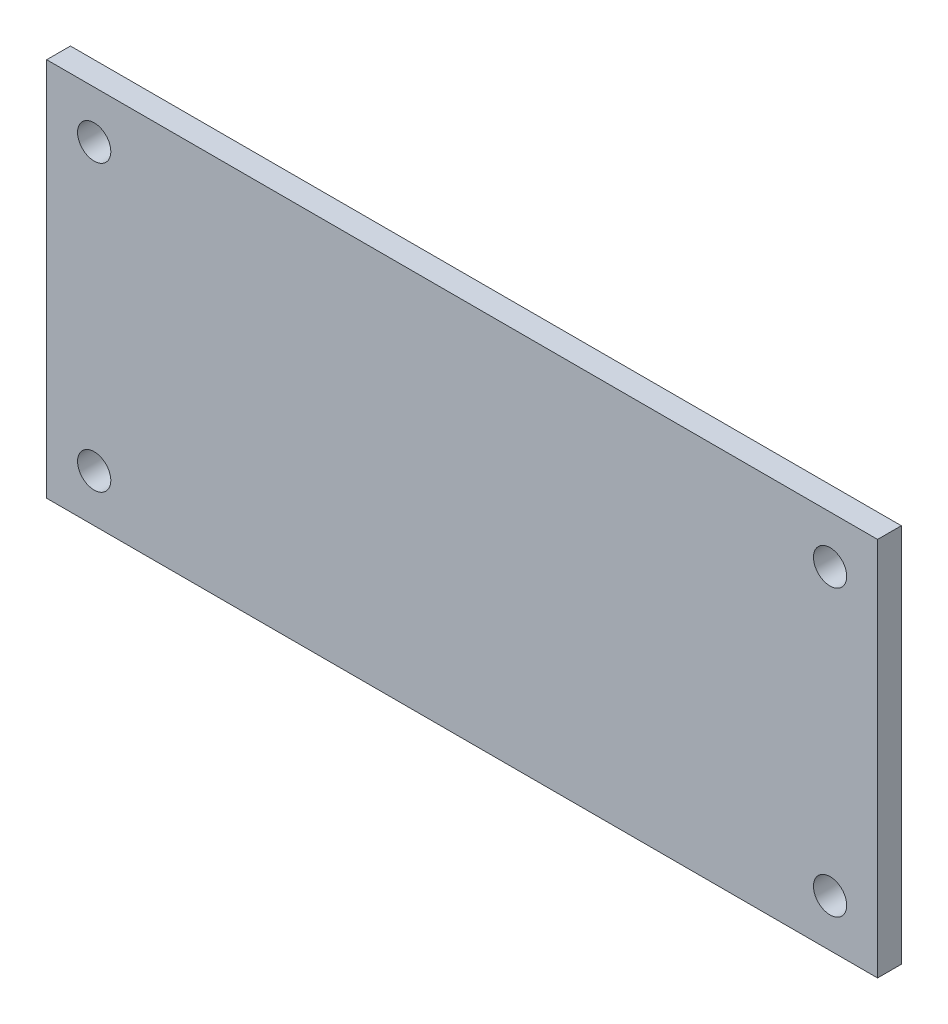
ISO-10303-21;
HEADER;
FILE_DESCRIPTION(('STEP AP214'),'2;1');
FILE_NAME('part.step','',(''),(''),'','','');
FILE_SCHEMA(('AUTOMOTIVE_DESIGN { 1 0 10303 214 1 1 1 1 }'));
ENDSEC;
DATA;
#1=APPLICATION_CONTEXT('core data for automotive mechanical design processes');
#2=APPLICATION_PROTOCOL_DEFINITION('international standard','automotive_design',2000,#1);
#3=PRODUCT_CONTEXT('',#1,'mechanical');
#4=PRODUCT('Part','Part','',(#3));
#5=PRODUCT_RELATED_PRODUCT_CATEGORY('part','',(#4));
#6=PRODUCT_DEFINITION_FORMATION('','',#4);
#7=PRODUCT_DEFINITION_CONTEXT('part definition',#1,'design');
#8=PRODUCT_DEFINITION('design','',#6,#7);
#9=PRODUCT_DEFINITION_SHAPE('','',#8);
#10=(LENGTH_UNIT() NAMED_UNIT(*) SI_UNIT(.MILLI.,.METRE.));
#11=(NAMED_UNIT(*) PLANE_ANGLE_UNIT() SI_UNIT($,.RADIAN.));
#12=(NAMED_UNIT(*) SI_UNIT($,.STERADIAN.) SOLID_ANGLE_UNIT());
#13=UNCERTAINTY_MEASURE_WITH_UNIT(LENGTH_MEASURE(1.E-05),#10,'distance_accuracy_value','');
#14=(GEOMETRIC_REPRESENTATION_CONTEXT(3) GLOBAL_UNCERTAINTY_ASSIGNED_CONTEXT((#13)) GLOBAL_UNIT_ASSIGNED_CONTEXT((#10,
#11,#12)) REPRESENTATION_CONTEXT('',''));
#15=CARTESIAN_POINT('',(0.,0.,0.));
#16=DIRECTION('',(0.,0.,1.));
#17=DIRECTION('',(1.,0.,0.));
#18=AXIS2_PLACEMENT_3D('',#15,#16,#17);
#19=CARTESIAN_POINT('',(-175.,45.0000000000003,10.));
#20=DIRECTION('',(0.,0.,0.999999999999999));
#21=DIRECTION('',(1.,0.,0.));
#22=AXIS2_PLACEMENT_3D('',#19,#20,#21);
#23=PLANE('',#22);
#24=CARTESIAN_POINT('',(155.,-95.0000000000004,10.));
#25=DIRECTION('',(0.,0.,0.999999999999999));
#26=DIRECTION('',(1.,0.,0.));
#27=AXIS2_PLACEMENT_3D('',#24,#25,#26);
#28=CIRCLE('',#27,7.00000000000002);
#29=CARTESIAN_POINT('',(148.,-95.0000000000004,10.));
#30=VERTEX_POINT('',#29);
#31=EDGE_CURVE('E127',#30,#30,#28,.T.);
#32=ORIENTED_EDGE('',*,*,#31,.F.);
#33=EDGE_LOOP('',(#32));
#34=FACE_BOUND('',#33,.T.);
#35=CARTESIAN_POINT('',(-155.,25.0000000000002,10.0000000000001));
#36=DIRECTION('',(0.,0.,0.999999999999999));
#37=DIRECTION('',(1.,0.,0.));
#38=AXIS2_PLACEMENT_3D('',#35,#36,#37);
#39=CIRCLE('',#38,7.00000000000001);
#40=CARTESIAN_POINT('',(-162.,25.0000000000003,10.0000000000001));
#41=VERTEX_POINT('',#40);
#42=EDGE_CURVE('E89',#41,#41,#39,.T.);
#43=ORIENTED_EDGE('',*,*,#42,.F.);
#44=EDGE_LOOP('',(#43));
#45=FACE_BOUND('',#44,.T.);
#46=DIRECTION('',(0.,-1.,0.));
#47=VECTOR('',#46,1.);
#48=CARTESIAN_POINT('',(-175.,45.0000000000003,10.));
#49=LINE('',#48,#47);
#50=CARTESIAN_POINT('',(-175.,45.0000000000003,10.));
#51=VERTEX_POINT('',#50);
#52=CARTESIAN_POINT('',(-175.,-115.,10.0000000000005));
#53=VERTEX_POINT('',#52);
#54=EDGE_CURVE('E99',#51,#53,#49,.T.);
#55=ORIENTED_EDGE('',*,*,#54,.T.);
#56=DIRECTION('',(1.,0.,0.));
#57=VECTOR('',#56,1.);
#58=CARTESIAN_POINT('',(-175.,-115.,10.0000000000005));
#59=LINE('',#58,#57);
#60=CARTESIAN_POINT('',(175.,-115.,10.0000000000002));
#61=VERTEX_POINT('',#60);
#62=EDGE_CURVE('E84',#53,#61,#59,.T.);
#63=ORIENTED_EDGE('',*,*,#62,.T.);
#64=DIRECTION('',(0.,1.,0.));
#65=VECTOR('',#64,1.);
#66=CARTESIAN_POINT('',(175.,44.9999999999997,10.));
#67=LINE('',#66,#65);
#68=CARTESIAN_POINT('',(175.,44.9999999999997,10.));
#69=VERTEX_POINT('',#68);
#70=EDGE_CURVE('E50',#61,#69,#67,.T.);
#71=ORIENTED_EDGE('',*,*,#70,.T.);
#72=DIRECTION('',(-1.,0.,0.));
#73=VECTOR('',#72,1.);
#74=CARTESIAN_POINT('',(-175.,45.0000000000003,10.));
#75=LINE('',#74,#73);
#76=EDGE_CURVE('E45',#69,#51,#75,.T.);
#77=ORIENTED_EDGE('',*,*,#76,.T.);
#78=EDGE_LOOP('',(#55,#63,#71,#77));
#79=FACE_BOUND('',#78,.T.);
#80=CARTESIAN_POINT('',(-155.,-94.9999999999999,10.));
#81=DIRECTION('',(0.,0.,0.999999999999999));
#82=DIRECTION('',(1.,0.,0.));
#83=AXIS2_PLACEMENT_3D('',#80,#81,#82);
#84=CIRCLE('',#83,7.00000000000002);
#85=CARTESIAN_POINT('',(-162.,-94.9999999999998,10.));
#86=VERTEX_POINT('',#85);
#87=EDGE_CURVE('E118',#86,#86,#84,.T.);
#88=ORIENTED_EDGE('',*,*,#87,.F.);
#89=EDGE_LOOP('',(#88));
#90=FACE_BOUND('',#89,.T.);
#91=CARTESIAN_POINT('',(155.,24.9999999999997,10.));
#92=DIRECTION('',(0.,0.,0.999999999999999));
#93=DIRECTION('',(1.,0.,0.));
#94=AXIS2_PLACEMENT_3D('',#91,#92,#93);
#95=CIRCLE('',#94,7.00000000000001);
#96=CARTESIAN_POINT('',(148.,24.9999999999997,10.));
#97=VERTEX_POINT('',#96);
#98=EDGE_CURVE('E121',#97,#97,#95,.T.);
#99=ORIENTED_EDGE('',*,*,#98,.F.);
#100=EDGE_LOOP('',(#99));
#101=FACE_BOUND('',#100,.T.);
#102=ADVANCED_FACE('F30',(#34,#45,#79,#90,#101),#23,.T.);
#103=CARTESIAN_POINT('',(-175.,45.0000000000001,1.11022302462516E-13));
#104=DIRECTION('',(0.,0.,0.999999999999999));
#105=DIRECTION('',(1.,0.,0.));
#106=AXIS2_PLACEMENT_3D('',#103,#104,#105);
#107=PLANE('',#106);
#108=CARTESIAN_POINT('',(155.,-95.0000000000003,2.22044604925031E-13));
#109=DIRECTION('',(0.,0.,0.999999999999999));
#110=DIRECTION('',(1.,0.,0.));
#111=AXIS2_PLACEMENT_3D('',#108,#109,#110);
#112=CIRCLE('',#111,7.00000000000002);
#113=CARTESIAN_POINT('',(148.,-95.0000000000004,2.22044604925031E-13));
#114=VERTEX_POINT('',#113);
#115=EDGE_CURVE('E123',#114,#114,#112,.T.);
#116=ORIENTED_EDGE('',*,*,#115,.T.);
#117=EDGE_LOOP('',(#116));
#118=FACE_BOUND('',#117,.T.);
#119=CARTESIAN_POINT('',(-155.,25.0000000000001,1.11022302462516E-13));
#120=DIRECTION('',(0.,0.,0.999999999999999));
#121=DIRECTION('',(1.,0.,0.));
#122=AXIS2_PLACEMENT_3D('',#119,#120,#121);
#123=CIRCLE('',#122,7.00000000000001);
#124=CARTESIAN_POINT('',(-162.,25.0000000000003,1.11022302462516E-13));
#125=VERTEX_POINT('',#124);
#126=EDGE_CURVE('E92',#125,#125,#123,.T.);
#127=ORIENTED_EDGE('',*,*,#126,.T.);
#128=EDGE_LOOP('',(#127));
#129=FACE_BOUND('',#128,.T.);
#130=DIRECTION('',(0.,-1.,0.));
#131=VECTOR('',#130,1.);
#132=CARTESIAN_POINT('',(-175.,45.0000000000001,1.11022302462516E-13));
#133=LINE('',#132,#131);
#134=CARTESIAN_POINT('',(-175.,45.0000000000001,1.11022302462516E-13));
#135=VERTEX_POINT('',#134);
#136=CARTESIAN_POINT('',(-175.,-115.,5.55111512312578E-13));
#137=VERTEX_POINT('',#136);
#138=EDGE_CURVE('E76',#135,#137,#133,.T.);
#139=ORIENTED_EDGE('',*,*,#138,.F.);
#140=DIRECTION('',(-1.,0.,0.));
#141=VECTOR('',#140,1.);
#142=CARTESIAN_POINT('',(-175.,45.0000000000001,1.11022302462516E-13));
#143=LINE('',#142,#141);
#144=CARTESIAN_POINT('',(175.,44.9999999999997,1.11022302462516E-13));
#145=VERTEX_POINT('',#144);
#146=EDGE_CURVE('E97',#145,#135,#143,.T.);
#147=ORIENTED_EDGE('',*,*,#146,.F.);
#148=DIRECTION('',(0.,1.,0.));
#149=VECTOR('',#148,1.);
#150=CARTESIAN_POINT('',(175.,44.9999999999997,1.11022302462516E-13));
#151=LINE('',#150,#149);
#152=CARTESIAN_POINT('',(175.,-115.,4.44089209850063E-13));
#153=VERTEX_POINT('',#152);
#154=EDGE_CURVE('E77',#153,#145,#151,.T.);
#155=ORIENTED_EDGE('',*,*,#154,.F.);
#156=DIRECTION('',(1.,0.,0.));
#157=VECTOR('',#156,1.);
#158=CARTESIAN_POINT('',(-175.,-115.,5.55111512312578E-13));
#159=LINE('',#158,#157);
#160=EDGE_CURVE('E71',#137,#153,#159,.T.);
#161=ORIENTED_EDGE('',*,*,#160,.F.);
#162=EDGE_LOOP('',(#139,#147,#155,#161));
#163=FACE_BOUND('',#162,.T.);
#164=CARTESIAN_POINT('',(-155.,-94.9999999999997,0.));
#165=DIRECTION('',(0.,0.,0.999999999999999));
#166=DIRECTION('',(1.,0.,0.));
#167=AXIS2_PLACEMENT_3D('',#164,#165,#166);
#168=CIRCLE('',#167,7.00000000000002);
#169=CARTESIAN_POINT('',(-162.,-94.9999999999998,0.));
#170=VERTEX_POINT('',#169);
#171=EDGE_CURVE('E134',#170,#170,#168,.T.);
#172=ORIENTED_EDGE('',*,*,#171,.T.);
#173=EDGE_LOOP('',(#172));
#174=FACE_BOUND('',#173,.T.);
#175=CARTESIAN_POINT('',(155.,24.9999999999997,0.));
#176=DIRECTION('',(0.,0.,0.999999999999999));
#177=DIRECTION('',(1.,0.,0.));
#178=AXIS2_PLACEMENT_3D('',#175,#176,#177);
#179=CIRCLE('',#178,7.00000000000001);
#180=CARTESIAN_POINT('',(148.,24.9999999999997,0.));
#181=VERTEX_POINT('',#180);
#182=EDGE_CURVE('E124',#181,#181,#179,.T.);
#183=ORIENTED_EDGE('',*,*,#182,.T.);
#184=EDGE_LOOP('',(#183));
#185=FACE_BOUND('',#184,.T.);
#186=ADVANCED_FACE('F72',(#118,#129,#163,#174,#185),#107,.F.);
#187=CARTESIAN_POINT('',(-175.,45.0000000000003,10.));
#188=DIRECTION('',(1.,0.,0.));
#189=DIRECTION('',(0.,0.,-0.999999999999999));
#190=AXIS2_PLACEMENT_3D('',#187,#188,#189);
#191=PLANE('',#190);
#192=ORIENTED_EDGE('',*,*,#138,.T.);
#193=DIRECTION('',(0.,0.,-0.999999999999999));
#194=VECTOR('',#193,1.);
#195=CARTESIAN_POINT('',(-175.,-115.,10.0000000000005));
#196=LINE('',#195,#194);
#197=EDGE_CURVE('E11',#53,#137,#196,.T.);
#198=ORIENTED_EDGE('',*,*,#197,.F.);
#199=ORIENTED_EDGE('',*,*,#54,.F.);
#200=DIRECTION('',(0.,0.,-0.999999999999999));
#201=VECTOR('',#200,1.);
#202=CARTESIAN_POINT('',(-175.,45.0000000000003,10.));
#203=LINE('',#202,#201);
#204=EDGE_CURVE('E88',#51,#135,#203,.T.);
#205=ORIENTED_EDGE('',*,*,#204,.T.);
#206=EDGE_LOOP('',(#192,#198,#199,#205));
#207=FACE_BOUND('',#206,.T.);
#208=ADVANCED_FACE('F32',(#207),#191,.F.);
#209=CARTESIAN_POINT('',(-175.,-115.,10.0000000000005));
#210=DIRECTION('',(0.,1.,0.));
#211=DIRECTION('',(-1.,0.,0.));
#212=AXIS2_PLACEMENT_3D('',#209,#210,#211);
#213=PLANE('',#212);
#214=ORIENTED_EDGE('',*,*,#160,.T.);
#215=DIRECTION('',(0.,0.,-0.999999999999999));
#216=VECTOR('',#215,1.);
#217=CARTESIAN_POINT('',(175.,-115.,10.0000000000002));
#218=LINE('',#217,#216);
#219=EDGE_CURVE('E38',#61,#153,#218,.T.);
#220=ORIENTED_EDGE('',*,*,#219,.F.);
#221=ORIENTED_EDGE('',*,*,#62,.F.);
#222=ORIENTED_EDGE('',*,*,#197,.T.);
#223=EDGE_LOOP('',(#214,#220,#221,#222));
#224=FACE_BOUND('',#223,.T.);
#225=ADVANCED_FACE('F83',(#224),#213,.F.);
#226=CARTESIAN_POINT('',(175.,44.9999999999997,10.));
#227=DIRECTION('',(-1.,0.,0.));
#228=DIRECTION('',(0.,0.,0.999999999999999));
#229=AXIS2_PLACEMENT_3D('',#226,#227,#228);
#230=PLANE('',#229);
#231=ORIENTED_EDGE('',*,*,#154,.T.);
#232=DIRECTION('',(0.,0.,-0.999999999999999));
#233=VECTOR('',#232,1.);
#234=CARTESIAN_POINT('',(175.,44.9999999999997,10.));
#235=LINE('',#234,#233);
#236=EDGE_CURVE('E105',#69,#145,#235,.T.);
#237=ORIENTED_EDGE('',*,*,#236,.F.);
#238=ORIENTED_EDGE('',*,*,#70,.F.);
#239=ORIENTED_EDGE('',*,*,#219,.T.);
#240=EDGE_LOOP('',(#231,#237,#238,#239));
#241=FACE_BOUND('',#240,.T.);
#242=ADVANCED_FACE('F108',(#241),#230,.F.);
#243=CARTESIAN_POINT('',(-175.,45.0000000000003,10.));
#244=DIRECTION('',(0.,-1.,0.));
#245=DIRECTION('',(0.,0.,-0.999999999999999));
#246=AXIS2_PLACEMENT_3D('',#243,#244,#245);
#247=PLANE('',#246);
#248=ORIENTED_EDGE('',*,*,#146,.T.);
#249=ORIENTED_EDGE('',*,*,#204,.F.);
#250=ORIENTED_EDGE('',*,*,#76,.F.);
#251=ORIENTED_EDGE('',*,*,#236,.T.);
#252=EDGE_LOOP('',(#248,#249,#250,#251));
#253=FACE_BOUND('',#252,.T.);
#254=ADVANCED_FACE('F110',(#253),#247,.F.);
#255=CARTESIAN_POINT('',(-155.,25.0000000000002,10.0000000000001));
#256=DIRECTION('',(0.,0.,-0.999999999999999));
#257=DIRECTION('',(-1.,0.,0.));
#258=AXIS2_PLACEMENT_3D('',#255,#256,#257);
#259=CYLINDRICAL_SURFACE('',#258,7.00000000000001);
#260=CARTESIAN_POINT('',(-162.,25.0000000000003,10.0000000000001));
#261=CARTESIAN_POINT('',(-162.,25.0000000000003,9.89583333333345));
#262=CARTESIAN_POINT('',(-162.,25.0000000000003,9.79166666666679));
#263=CARTESIAN_POINT('',(-162.,25.0000000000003,9.58333333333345));
#264=CARTESIAN_POINT('',(-162.,25.0000000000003,9.47916666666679));
#265=CARTESIAN_POINT('',(-162.,25.0000000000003,9.27083333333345));
#266=CARTESIAN_POINT('',(-162.,25.0000000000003,9.16666666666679));
#267=CARTESIAN_POINT('',(-162.,25.0000000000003,8.95833333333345));
#268=CARTESIAN_POINT('',(-162.,25.0000000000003,8.85416666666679));
#269=CARTESIAN_POINT('',(-162.,25.0000000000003,8.64583333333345));
#270=CARTESIAN_POINT('',(-162.,25.0000000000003,8.54166666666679));
#271=CARTESIAN_POINT('',(-162.,25.0000000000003,8.33333333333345));
#272=CARTESIAN_POINT('',(-162.,25.0000000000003,8.22916666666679));
#273=CARTESIAN_POINT('',(-162.,25.0000000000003,8.02083333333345));
#274=CARTESIAN_POINT('',(-162.,25.0000000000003,7.91666666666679));
#275=CARTESIAN_POINT('',(-162.,25.0000000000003,7.70833333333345));
#276=CARTESIAN_POINT('',(-162.,25.0000000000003,7.60416666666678));
#277=CARTESIAN_POINT('',(-162.,25.0000000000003,7.39583333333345));
#278=CARTESIAN_POINT('',(-162.,25.0000000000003,7.29166666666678));
#279=CARTESIAN_POINT('',(-162.,25.0000000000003,7.08333333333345));
#280=CARTESIAN_POINT('',(-162.,25.0000000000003,6.97916666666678));
#281=CARTESIAN_POINT('',(-162.,25.0000000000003,6.77083333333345));
#282=CARTESIAN_POINT('',(-162.,25.0000000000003,6.66666666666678));
#283=CARTESIAN_POINT('',(-162.,25.0000000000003,6.45833333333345));
#284=CARTESIAN_POINT('',(-162.,25.0000000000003,6.35416666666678));
#285=CARTESIAN_POINT('',(-162.,25.0000000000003,6.14583333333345));
#286=CARTESIAN_POINT('',(-162.,25.0000000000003,6.04166666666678));
#287=CARTESIAN_POINT('',(-162.,25.0000000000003,5.83333333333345));
#288=CARTESIAN_POINT('',(-162.,25.0000000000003,5.72916666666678));
#289=CARTESIAN_POINT('',(-162.,25.0000000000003,5.52083333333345));
#290=CARTESIAN_POINT('',(-162.,25.0000000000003,5.41666666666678));
#291=CARTESIAN_POINT('',(-162.,25.0000000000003,5.20833333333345));
#292=CARTESIAN_POINT('',(-162.,25.0000000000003,5.10416666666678));
#293=CARTESIAN_POINT('',(-162.,25.0000000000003,4.89583333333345));
#294=CARTESIAN_POINT('',(-162.,25.0000000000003,4.79166666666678));
#295=CARTESIAN_POINT('',(-162.,25.0000000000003,4.58333333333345));
#296=CARTESIAN_POINT('',(-162.,25.0000000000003,4.47916666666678));
#297=CARTESIAN_POINT('',(-162.,25.0000000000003,4.27083333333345));
#298=CARTESIAN_POINT('',(-162.,25.0000000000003,4.16666666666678));
#299=CARTESIAN_POINT('',(-162.,25.0000000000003,3.95833333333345));
#300=CARTESIAN_POINT('',(-162.,25.0000000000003,3.85416666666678));
#301=CARTESIAN_POINT('',(-162.,25.0000000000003,3.64583333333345));
#302=CARTESIAN_POINT('',(-162.,25.0000000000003,3.54166666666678));
#303=CARTESIAN_POINT('',(-162.,25.0000000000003,3.33333333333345));
#304=CARTESIAN_POINT('',(-162.,25.0000000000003,3.22916666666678));
#305=CARTESIAN_POINT('',(-162.,25.0000000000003,3.02083333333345));
#306=CARTESIAN_POINT('',(-162.,25.0000000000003,2.91666666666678));
#307=CARTESIAN_POINT('',(-162.,25.0000000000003,2.70833333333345));
#308=CARTESIAN_POINT('',(-162.,25.0000000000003,2.60416666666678));
#309=CARTESIAN_POINT('',(-162.,25.0000000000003,2.39583333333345));
#310=CARTESIAN_POINT('',(-162.,25.0000000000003,2.29166666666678));
#311=CARTESIAN_POINT('',(-162.,25.0000000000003,2.08333333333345));
#312=CARTESIAN_POINT('',(-162.,25.0000000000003,1.97916666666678));
#313=CARTESIAN_POINT('',(-162.,25.0000000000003,1.77083333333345));
#314=CARTESIAN_POINT('',(-162.,25.0000000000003,1.66666666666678));
#315=CARTESIAN_POINT('',(-162.,25.0000000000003,1.45833333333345));
#316=CARTESIAN_POINT('',(-162.,25.0000000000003,1.35416666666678));
#317=CARTESIAN_POINT('',(-162.,25.0000000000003,1.14583333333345));
#318=CARTESIAN_POINT('',(-162.,25.0000000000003,1.04166666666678));
#319=CARTESIAN_POINT('',(-162.,25.0000000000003,0.833333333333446));
#320=CARTESIAN_POINT('',(-162.,25.0000000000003,0.729166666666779));
#321=CARTESIAN_POINT('',(-162.,25.0000000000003,0.520833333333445));
#322=CARTESIAN_POINT('',(-162.,25.0000000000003,0.416666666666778));
#323=CARTESIAN_POINT('',(-162.,25.0000000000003,0.208333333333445));
#324=CARTESIAN_POINT('',(-162.,25.0000000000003,0.104166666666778));
#325=CARTESIAN_POINT('',(-162.,25.0000000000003,1.11022302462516E-13));
#326=B_SPLINE_CURVE_WITH_KNOTS('',3,(#260,#261,#262,#263,#264,#265,#266,#267,#268,#269,#270,
#271,#272,#273,#274,#275,#276,#277,#278,#279,#280,#281,#282,#283,#284,#285,#286,#287,#288,#289,
#290,#291,#292,#293,#294,#295,#296,#297,#298,#299,#300,#301,#302,#303,#304,#305,#306,#307,#308,
#309,#310,#311,#312,#313,#314,#315,#316,#317,#318,#319,#320,#321,#322,#323,#324,#325),
.UNSPECIFIED.,.F.,.F.,(4,2,2,2,2,2,2,2,2,2,2,2,2,2,2,2,2,2,2,2,2,2,2,2,2,2,2,2,2,2,2,2,4),(0.,
0.3125,0.625000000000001,0.937500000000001,1.25,1.5625,1.875,2.1875,2.5,2.8125,3.125,3.4375,
3.75,4.0625,4.375,4.68750000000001,5.00000000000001,5.3125,5.62500000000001,5.93750000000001,
6.25000000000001,6.56250000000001,6.87500000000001,7.18750000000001,7.50000000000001,
7.81250000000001,8.12500000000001,8.43750000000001,8.75000000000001,9.06250000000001,
9.37500000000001,9.68750000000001,10.),.UNSPECIFIED.);
#327=EDGE_CURVE('BSEAM141',#41,#125,#326,.T.);
#328=ORIENTED_EDGE('',*,*,#42,.T.);
#329=ORIENTED_EDGE('',*,*,#126,.F.);
#330=ORIENTED_EDGE('',*,*,#327,.T.);
#331=ORIENTED_EDGE('',*,*,#327,.F.);
#332=EDGE_LOOP('',(#328,#330,#329,#331));
#333=FACE_BOUND('',#332,.T.);
#334=ADVANCED_FACE('F141',(#333),#259,.F.);
#335=CARTESIAN_POINT('',(-155.,-94.9999999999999,10.));
#336=DIRECTION('',(0.,0.,-0.999999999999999));
#337=DIRECTION('',(-1.,0.,0.));
#338=AXIS2_PLACEMENT_3D('',#335,#336,#337);
#339=CYLINDRICAL_SURFACE('',#338,7.00000000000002);
#340=CARTESIAN_POINT('',(-162.,-94.9999999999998,10.));
#341=CARTESIAN_POINT('',(-162.,-94.9999999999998,9.89583333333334));
#342=CARTESIAN_POINT('',(-162.,-94.9999999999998,9.79166666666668));
#343=CARTESIAN_POINT('',(-162.,-94.9999999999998,9.58333333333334));
#344=CARTESIAN_POINT('',(-162.,-94.9999999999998,9.47916666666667));
#345=CARTESIAN_POINT('',(-162.,-94.9999999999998,9.27083333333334));
#346=CARTESIAN_POINT('',(-162.,-94.9999999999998,9.16666666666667));
#347=CARTESIAN_POINT('',(-162.,-94.9999999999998,8.95833333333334));
#348=CARTESIAN_POINT('',(-162.,-94.9999999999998,8.85416666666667));
#349=CARTESIAN_POINT('',(-162.,-94.9999999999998,8.64583333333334));
#350=CARTESIAN_POINT('',(-162.,-94.9999999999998,8.54166666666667));
#351=CARTESIAN_POINT('',(-162.,-94.9999999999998,8.33333333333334));
#352=CARTESIAN_POINT('',(-162.,-94.9999999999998,8.22916666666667));
#353=CARTESIAN_POINT('',(-162.,-94.9999999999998,8.02083333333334));
#354=CARTESIAN_POINT('',(-162.,-94.9999999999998,7.91666666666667));
#355=CARTESIAN_POINT('',(-162.,-94.9999999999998,7.70833333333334));
#356=CARTESIAN_POINT('',(-162.,-94.9999999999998,7.60416666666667));
#357=CARTESIAN_POINT('',(-162.,-94.9999999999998,7.39583333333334));
#358=CARTESIAN_POINT('',(-162.,-94.9999999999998,7.29166666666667));
#359=CARTESIAN_POINT('',(-162.,-94.9999999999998,7.08333333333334));
#360=CARTESIAN_POINT('',(-162.,-94.9999999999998,6.97916666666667));
#361=CARTESIAN_POINT('',(-162.,-94.9999999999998,6.77083333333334));
#362=CARTESIAN_POINT('',(-162.,-94.9999999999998,6.66666666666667));
#363=CARTESIAN_POINT('',(-162.,-94.9999999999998,6.45833333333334));
#364=CARTESIAN_POINT('',(-162.,-94.9999999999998,6.35416666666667));
#365=CARTESIAN_POINT('',(-162.,-94.9999999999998,6.14583333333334));
#366=CARTESIAN_POINT('',(-162.,-94.9999999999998,6.04166666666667));
#367=CARTESIAN_POINT('',(-162.,-94.9999999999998,5.83333333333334));
#368=CARTESIAN_POINT('',(-162.,-94.9999999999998,5.72916666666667));
#369=CARTESIAN_POINT('',(-162.,-94.9999999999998,5.52083333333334));
#370=CARTESIAN_POINT('',(-162.,-94.9999999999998,5.41666666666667));
#371=CARTESIAN_POINT('',(-162.,-94.9999999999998,5.20833333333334));
#372=CARTESIAN_POINT('',(-162.,-94.9999999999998,5.10416666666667));
#373=CARTESIAN_POINT('',(-162.,-94.9999999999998,4.89583333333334));
#374=CARTESIAN_POINT('',(-162.,-94.9999999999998,4.79166666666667));
#375=CARTESIAN_POINT('',(-162.,-94.9999999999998,4.58333333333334));
#376=CARTESIAN_POINT('',(-162.,-94.9999999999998,4.47916666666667));
#377=CARTESIAN_POINT('',(-162.,-94.9999999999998,4.27083333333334));
#378=CARTESIAN_POINT('',(-162.,-94.9999999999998,4.16666666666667));
#379=CARTESIAN_POINT('',(-162.,-94.9999999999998,3.95833333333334));
#380=CARTESIAN_POINT('',(-162.,-94.9999999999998,3.85416666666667));
#381=CARTESIAN_POINT('',(-162.,-94.9999999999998,3.64583333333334));
#382=CARTESIAN_POINT('',(-162.,-94.9999999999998,3.54166666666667));
#383=CARTESIAN_POINT('',(-162.,-94.9999999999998,3.33333333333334));
#384=CARTESIAN_POINT('',(-162.,-94.9999999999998,3.22916666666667));
#385=CARTESIAN_POINT('',(-162.,-94.9999999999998,3.02083333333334));
#386=CARTESIAN_POINT('',(-162.,-94.9999999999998,2.91666666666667));
#387=CARTESIAN_POINT('',(-162.,-94.9999999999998,2.70833333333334));
#388=CARTESIAN_POINT('',(-162.,-94.9999999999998,2.60416666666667));
#389=CARTESIAN_POINT('',(-162.,-94.9999999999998,2.39583333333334));
#390=CARTESIAN_POINT('',(-162.,-94.9999999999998,2.29166666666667));
#391=CARTESIAN_POINT('',(-162.,-94.9999999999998,2.08333333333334));
#392=CARTESIAN_POINT('',(-162.,-94.9999999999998,1.97916666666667));
#393=CARTESIAN_POINT('',(-162.,-94.9999999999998,1.77083333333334));
#394=CARTESIAN_POINT('',(-162.,-94.9999999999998,1.66666666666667));
#395=CARTESIAN_POINT('',(-162.,-94.9999999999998,1.45833333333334));
#396=CARTESIAN_POINT('',(-162.,-94.9999999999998,1.35416666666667));
#397=CARTESIAN_POINT('',(-162.,-94.9999999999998,1.14583333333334));
#398=CARTESIAN_POINT('',(-162.,-94.9999999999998,1.04166666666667));
#399=CARTESIAN_POINT('',(-162.,-94.9999999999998,0.833333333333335));
#400=CARTESIAN_POINT('',(-162.,-94.9999999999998,0.729166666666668));
#401=CARTESIAN_POINT('',(-162.,-94.9999999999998,0.520833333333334));
#402=CARTESIAN_POINT('',(-162.,-94.9999999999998,0.416666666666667));
#403=CARTESIAN_POINT('',(-162.,-94.9999999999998,0.208333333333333));
#404=CARTESIAN_POINT('',(-162.,-94.9999999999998,0.104166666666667));
#405=CARTESIAN_POINT('',(-162.,-94.9999999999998,0.));
#406=B_SPLINE_CURVE_WITH_KNOTS('',3,(#340,#341,#342,#343,#344,#345,#346,#347,#348,#349,#350,
#351,#352,#353,#354,#355,#356,#357,#358,#359,#360,#361,#362,#363,#364,#365,#366,#367,#368,#369,
#370,#371,#372,#373,#374,#375,#376,#377,#378,#379,#380,#381,#382,#383,#384,#385,#386,#387,#388,
#389,#390,#391,#392,#393,#394,#395,#396,#397,#398,#399,#400,#401,#402,#403,#404,#405),
.UNSPECIFIED.,.F.,.F.,(4,2,2,2,2,2,2,2,2,2,2,2,2,2,2,2,2,2,2,2,2,2,2,2,2,2,2,2,2,2,2,2,4),(0.,
0.3125,0.625000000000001,0.937500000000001,1.25,1.5625,1.875,2.1875,2.5,2.8125,3.125,3.4375,
3.75,4.0625,4.375,4.68750000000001,5.00000000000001,5.3125,5.62500000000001,5.93750000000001,
6.25000000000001,6.56250000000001,6.87500000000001,7.18750000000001,7.50000000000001,
7.81250000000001,8.12500000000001,8.43750000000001,8.75000000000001,9.06250000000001,
9.37500000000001,9.68750000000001,10.),.UNSPECIFIED.);
#407=EDGE_CURVE('BSEAM143',#86,#170,#406,.T.);
#408=ORIENTED_EDGE('',*,*,#87,.T.);
#409=ORIENTED_EDGE('',*,*,#171,.F.);
#410=ORIENTED_EDGE('',*,*,#407,.T.);
#411=ORIENTED_EDGE('',*,*,#407,.F.);
#412=EDGE_LOOP('',(#408,#410,#409,#411));
#413=FACE_BOUND('',#412,.T.);
#414=ADVANCED_FACE('F143',(#413),#339,.F.);
#415=CARTESIAN_POINT('',(155.,-95.0000000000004,10.));
#416=DIRECTION('',(0.,0.,-0.999999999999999));
#417=DIRECTION('',(-1.,0.,0.));
#418=AXIS2_PLACEMENT_3D('',#415,#416,#417);
#419=CYLINDRICAL_SURFACE('',#418,7.00000000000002);
#420=CARTESIAN_POINT('',(148.,-95.0000000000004,10.));
#421=CARTESIAN_POINT('',(148.,-95.0000000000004,9.89583333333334));
#422=CARTESIAN_POINT('',(148.,-95.0000000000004,9.79166666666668));
#423=CARTESIAN_POINT('',(148.,-95.0000000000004,9.58333333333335));
#424=CARTESIAN_POINT('',(148.,-95.0000000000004,9.47916666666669));
#425=CARTESIAN_POINT('',(148.,-95.0000000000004,9.27083333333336));
#426=CARTESIAN_POINT('',(148.,-95.0000000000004,9.16666666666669));
#427=CARTESIAN_POINT('',(148.,-95.0000000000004,8.95833333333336));
#428=CARTESIAN_POINT('',(148.,-95.0000000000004,8.8541666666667));
#429=CARTESIAN_POINT('',(148.,-95.0000000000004,8.64583333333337));
#430=CARTESIAN_POINT('',(148.,-95.0000000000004,8.54166666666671));
#431=CARTESIAN_POINT('',(148.,-95.0000000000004,8.33333333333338));
#432=CARTESIAN_POINT('',(148.,-95.0000000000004,8.22916666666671));
#433=CARTESIAN_POINT('',(148.,-95.0000000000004,8.02083333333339));
#434=CARTESIAN_POINT('',(148.,-95.0000000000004,7.91666666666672));
#435=CARTESIAN_POINT('',(148.,-95.0000000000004,7.70833333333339));
#436=CARTESIAN_POINT('',(148.,-95.0000000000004,7.60416666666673));
#437=CARTESIAN_POINT('',(148.,-95.0000000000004,7.3958333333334));
#438=CARTESIAN_POINT('',(148.,-95.0000000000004,7.29166666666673));
#439=CARTESIAN_POINT('',(148.,-95.0000000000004,7.0833333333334));
#440=CARTESIAN_POINT('',(148.,-95.0000000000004,6.97916666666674));
#441=CARTESIAN_POINT('',(148.,-95.0000000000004,6.77083333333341));
#442=CARTESIAN_POINT('',(148.,-95.0000000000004,6.66666666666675));
#443=CARTESIAN_POINT('',(148.,-95.0000000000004,6.45833333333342));
#444=CARTESIAN_POINT('',(148.,-95.0000000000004,6.35416666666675));
#445=CARTESIAN_POINT('',(148.,-95.0000000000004,6.14583333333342));
#446=CARTESIAN_POINT('',(148.,-95.0000000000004,6.04166666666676));
#447=CARTESIAN_POINT('',(148.,-95.0000000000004,5.83333333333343));
#448=CARTESIAN_POINT('',(148.,-95.0000000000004,5.72916666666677));
#449=CARTESIAN_POINT('',(148.,-95.0000000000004,5.52083333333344));
#450=CARTESIAN_POINT('',(148.,-95.0000000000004,5.41666666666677));
#451=CARTESIAN_POINT('',(148.,-95.0000000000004,5.20833333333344));
#452=CARTESIAN_POINT('',(148.,-95.0000000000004,5.10416666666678));
#453=CARTESIAN_POINT('',(148.,-95.0000000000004,4.89583333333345));
#454=CARTESIAN_POINT('',(148.,-95.0000000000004,4.79166666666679));
#455=CARTESIAN_POINT('',(148.,-95.0000000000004,4.58333333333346));
#456=CARTESIAN_POINT('',(148.,-95.0000000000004,4.47916666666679));
#457=CARTESIAN_POINT('',(148.,-95.0000000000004,4.27083333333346));
#458=CARTESIAN_POINT('',(148.,-95.0000000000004,4.1666666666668));
#459=CARTESIAN_POINT('',(148.,-95.0000000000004,3.95833333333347));
#460=CARTESIAN_POINT('',(148.,-95.0000000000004,3.85416666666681));
#461=CARTESIAN_POINT('',(148.,-95.0000000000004,3.64583333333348));
#462=CARTESIAN_POINT('',(148.,-95.0000000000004,3.54166666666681));
#463=CARTESIAN_POINT('',(148.,-95.0000000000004,3.33333333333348));
#464=CARTESIAN_POINT('',(148.,-95.0000000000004,3.22916666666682));
#465=CARTESIAN_POINT('',(148.,-95.0000000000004,3.02083333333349));
#466=CARTESIAN_POINT('',(148.,-95.0000000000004,2.91666666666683));
#467=CARTESIAN_POINT('',(148.,-95.0000000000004,2.7083333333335));
#468=CARTESIAN_POINT('',(148.,-95.0000000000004,2.60416666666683));
#469=CARTESIAN_POINT('',(148.,-95.0000000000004,2.39583333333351));
#470=CARTESIAN_POINT('',(148.,-95.0000000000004,2.29166666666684));
#471=CARTESIAN_POINT('',(148.,-95.0000000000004,2.08333333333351));
#472=CARTESIAN_POINT('',(148.,-95.0000000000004,1.97916666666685));
#473=CARTESIAN_POINT('',(148.,-95.0000000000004,1.77083333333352));
#474=CARTESIAN_POINT('',(148.,-95.0000000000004,1.66666666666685));
#475=CARTESIAN_POINT('',(148.,-95.0000000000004,1.45833333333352));
#476=CARTESIAN_POINT('',(148.,-95.0000000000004,1.35416666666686));
#477=CARTESIAN_POINT('',(148.,-95.0000000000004,1.14583333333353));
#478=CARTESIAN_POINT('',(148.,-95.0000000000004,1.04166666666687));
#479=CARTESIAN_POINT('',(148.,-95.0000000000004,0.833333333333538));
#480=CARTESIAN_POINT('',(148.,-95.0000000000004,0.729166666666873));
#481=CARTESIAN_POINT('',(148.,-95.0000000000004,0.520833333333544));
#482=CARTESIAN_POINT('',(148.,-95.0000000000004,0.41666666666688));
#483=CARTESIAN_POINT('',(148.,-95.0000000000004,0.208333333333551));
#484=CARTESIAN_POINT('',(148.,-95.0000000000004,0.104166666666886));
#485=CARTESIAN_POINT('',(148.,-95.0000000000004,2.22044604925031E-13));
#486=B_SPLINE_CURVE_WITH_KNOTS('',3,(#420,#421,#422,#423,#424,#425,#426,#427,#428,#429,#430,
#431,#432,#433,#434,#435,#436,#437,#438,#439,#440,#441,#442,#443,#444,#445,#446,#447,#448,#449,
#450,#451,#452,#453,#454,#455,#456,#457,#458,#459,#460,#461,#462,#463,#464,#465,#466,#467,#468,
#469,#470,#471,#472,#473,#474,#475,#476,#477,#478,#479,#480,#481,#482,#483,#484,#485),
.UNSPECIFIED.,.F.,.F.,(4,2,2,2,2,2,2,2,2,2,2,2,2,2,2,2,2,2,2,2,2,2,2,2,2,2,2,2,2,2,2,2,4),(0.,
0.312499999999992,0.624999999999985,0.937499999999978,1.24999999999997,1.56249999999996,
1.87499999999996,2.18749999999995,2.49999999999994,2.81249999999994,3.12499999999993,
3.43749999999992,3.74999999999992,4.06249999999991,4.3749999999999,4.6874999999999,
4.99999999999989,5.31249999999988,5.62499999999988,5.93749999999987,6.24999999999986,
6.56249999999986,6.87499999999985,7.18749999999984,7.49999999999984,7.81249999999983,
8.12499999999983,8.43749999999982,8.74999999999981,9.0624999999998,9.3749999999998,
9.68749999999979,9.99999999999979),.UNSPECIFIED.);
#487=EDGE_CURVE('BSEAM150',#30,#114,#486,.T.);
#488=ORIENTED_EDGE('',*,*,#31,.T.);
#489=ORIENTED_EDGE('',*,*,#115,.F.);
#490=ORIENTED_EDGE('',*,*,#487,.T.);
#491=ORIENTED_EDGE('',*,*,#487,.F.);
#492=EDGE_LOOP('',(#488,#490,#489,#491));
#493=FACE_BOUND('',#492,.T.);
#494=ADVANCED_FACE('F150',(#493),#419,.F.);
#495=CARTESIAN_POINT('',(155.,24.9999999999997,10.));
#496=DIRECTION('',(0.,0.,-0.999999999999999));
#497=DIRECTION('',(-1.,0.,0.));
#498=AXIS2_PLACEMENT_3D('',#495,#496,#497);
#499=CYLINDRICAL_SURFACE('',#498,7.00000000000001);
#500=CARTESIAN_POINT('',(148.,24.9999999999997,10.));
#501=CARTESIAN_POINT('',(148.,24.9999999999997,9.89583333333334));
#502=CARTESIAN_POINT('',(148.,24.9999999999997,9.79166666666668));
#503=CARTESIAN_POINT('',(148.,24.9999999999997,9.58333333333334));
#504=CARTESIAN_POINT('',(148.,24.9999999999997,9.47916666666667));
#505=CARTESIAN_POINT('',(148.,24.9999999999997,9.27083333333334));
#506=CARTESIAN_POINT('',(148.,24.9999999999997,9.16666666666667));
#507=CARTESIAN_POINT('',(148.,24.9999999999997,8.95833333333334));
#508=CARTESIAN_POINT('',(148.,24.9999999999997,8.85416666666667));
#509=CARTESIAN_POINT('',(148.,24.9999999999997,8.64583333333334));
#510=CARTESIAN_POINT('',(148.,24.9999999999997,8.54166666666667));
#511=CARTESIAN_POINT('',(148.,24.9999999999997,8.33333333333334));
#512=CARTESIAN_POINT('',(148.,24.9999999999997,8.22916666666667));
#513=CARTESIAN_POINT('',(148.,24.9999999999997,8.02083333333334));
#514=CARTESIAN_POINT('',(148.,24.9999999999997,7.91666666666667));
#515=CARTESIAN_POINT('',(148.,24.9999999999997,7.70833333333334));
#516=CARTESIAN_POINT('',(148.,24.9999999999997,7.60416666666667));
#517=CARTESIAN_POINT('',(148.,24.9999999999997,7.39583333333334));
#518=CARTESIAN_POINT('',(148.,24.9999999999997,7.29166666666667));
#519=CARTESIAN_POINT('',(148.,24.9999999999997,7.08333333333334));
#520=CARTESIAN_POINT('',(148.,24.9999999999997,6.97916666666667));
#521=CARTESIAN_POINT('',(148.,24.9999999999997,6.77083333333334));
#522=CARTESIAN_POINT('',(148.,24.9999999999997,6.66666666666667));
#523=CARTESIAN_POINT('',(148.,24.9999999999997,6.45833333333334));
#524=CARTESIAN_POINT('',(148.,24.9999999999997,6.35416666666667));
#525=CARTESIAN_POINT('',(148.,24.9999999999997,6.14583333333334));
#526=CARTESIAN_POINT('',(148.,24.9999999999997,6.04166666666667));
#527=CARTESIAN_POINT('',(148.,24.9999999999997,5.83333333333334));
#528=CARTESIAN_POINT('',(148.,24.9999999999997,5.72916666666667));
#529=CARTESIAN_POINT('',(148.,24.9999999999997,5.52083333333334));
#530=CARTESIAN_POINT('',(148.,24.9999999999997,5.41666666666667));
#531=CARTESIAN_POINT('',(148.,24.9999999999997,5.20833333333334));
#532=CARTESIAN_POINT('',(148.,24.9999999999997,5.10416666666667));
#533=CARTESIAN_POINT('',(148.,24.9999999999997,4.89583333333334));
#534=CARTESIAN_POINT('',(148.,24.9999999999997,4.79166666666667));
#535=CARTESIAN_POINT('',(148.,24.9999999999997,4.58333333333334));
#536=CARTESIAN_POINT('',(148.,24.9999999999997,4.47916666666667));
#537=CARTESIAN_POINT('',(148.,24.9999999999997,4.27083333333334));
#538=CARTESIAN_POINT('',(148.,24.9999999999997,4.16666666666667));
#539=CARTESIAN_POINT('',(148.,24.9999999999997,3.95833333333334));
#540=CARTESIAN_POINT('',(148.,24.9999999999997,3.85416666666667));
#541=CARTESIAN_POINT('',(148.,24.9999999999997,3.64583333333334));
#542=CARTESIAN_POINT('',(148.,24.9999999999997,3.54166666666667));
#543=CARTESIAN_POINT('',(148.,24.9999999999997,3.33333333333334));
#544=CARTESIAN_POINT('',(148.,24.9999999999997,3.22916666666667));
#545=CARTESIAN_POINT('',(148.,24.9999999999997,3.02083333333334));
#546=CARTESIAN_POINT('',(148.,24.9999999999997,2.91666666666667));
#547=CARTESIAN_POINT('',(148.,24.9999999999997,2.70833333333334));
#548=CARTESIAN_POINT('',(148.,24.9999999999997,2.60416666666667));
#549=CARTESIAN_POINT('',(148.,24.9999999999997,2.39583333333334));
#550=CARTESIAN_POINT('',(148.,24.9999999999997,2.29166666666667));
#551=CARTESIAN_POINT('',(148.,24.9999999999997,2.08333333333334));
#552=CARTESIAN_POINT('',(148.,24.9999999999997,1.97916666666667));
#553=CARTESIAN_POINT('',(148.,24.9999999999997,1.77083333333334));
#554=CARTESIAN_POINT('',(148.,24.9999999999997,1.66666666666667));
#555=CARTESIAN_POINT('',(148.,24.9999999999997,1.45833333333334));
#556=CARTESIAN_POINT('',(148.,24.9999999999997,1.35416666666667));
#557=CARTESIAN_POINT('',(148.,24.9999999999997,1.14583333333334));
#558=CARTESIAN_POINT('',(148.,24.9999999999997,1.04166666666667));
#559=CARTESIAN_POINT('',(148.,24.9999999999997,0.833333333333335));
#560=CARTESIAN_POINT('',(148.,24.9999999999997,0.729166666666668));
#561=CARTESIAN_POINT('',(148.,24.9999999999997,0.520833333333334));
#562=CARTESIAN_POINT('',(148.,24.9999999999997,0.416666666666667));
#563=CARTESIAN_POINT('',(148.,24.9999999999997,0.208333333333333));
#564=CARTESIAN_POINT('',(148.,24.9999999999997,0.104166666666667));
#565=CARTESIAN_POINT('',(148.,24.9999999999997,0.));
#566=B_SPLINE_CURVE_WITH_KNOTS('',3,(#500,#501,#502,#503,#504,#505,#506,#507,#508,#509,#510,
#511,#512,#513,#514,#515,#516,#517,#518,#519,#520,#521,#522,#523,#524,#525,#526,#527,#528,#529,
#530,#531,#532,#533,#534,#535,#536,#537,#538,#539,#540,#541,#542,#543,#544,#545,#546,#547,#548,
#549,#550,#551,#552,#553,#554,#555,#556,#557,#558,#559,#560,#561,#562,#563,#564,#565),
.UNSPECIFIED.,.F.,.F.,(4,2,2,2,2,2,2,2,2,2,2,2,2,2,2,2,2,2,2,2,2,2,2,2,2,2,2,2,2,2,2,2,4),(0.,
0.3125,0.625000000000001,0.937500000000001,1.25,1.5625,1.875,2.1875,2.5,2.8125,3.125,3.4375,
3.75,4.0625,4.375,4.68750000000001,5.00000000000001,5.3125,5.62500000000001,5.93750000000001,
6.25000000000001,6.56250000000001,6.87500000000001,7.18750000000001,7.50000000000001,
7.81250000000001,8.12500000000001,8.43750000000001,8.75000000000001,9.06250000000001,
9.37500000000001,9.68750000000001,10.),.UNSPECIFIED.);
#567=EDGE_CURVE('BSEAM197',#97,#181,#566,.T.);
#568=ORIENTED_EDGE('',*,*,#98,.T.);
#569=ORIENTED_EDGE('',*,*,#182,.F.);
#570=ORIENTED_EDGE('',*,*,#567,.T.);
#571=ORIENTED_EDGE('',*,*,#567,.F.);
#572=EDGE_LOOP('',(#568,#570,#569,#571));
#573=FACE_BOUND('',#572,.T.);
#574=ADVANCED_FACE('F197',(#573),#499,.F.);
#575=CLOSED_SHELL('',(#102,#186,#208,#225,#242,#254,#334,#414,#494,#574));
#576=MANIFOLD_SOLID_BREP('B2',#575);
#577=ADVANCED_BREP_SHAPE_REPRESENTATION('',(#18,#576),#14);
#578=SHAPE_DEFINITION_REPRESENTATION(#9,#577);
ENDSEC;
END-ISO-10303-21;
